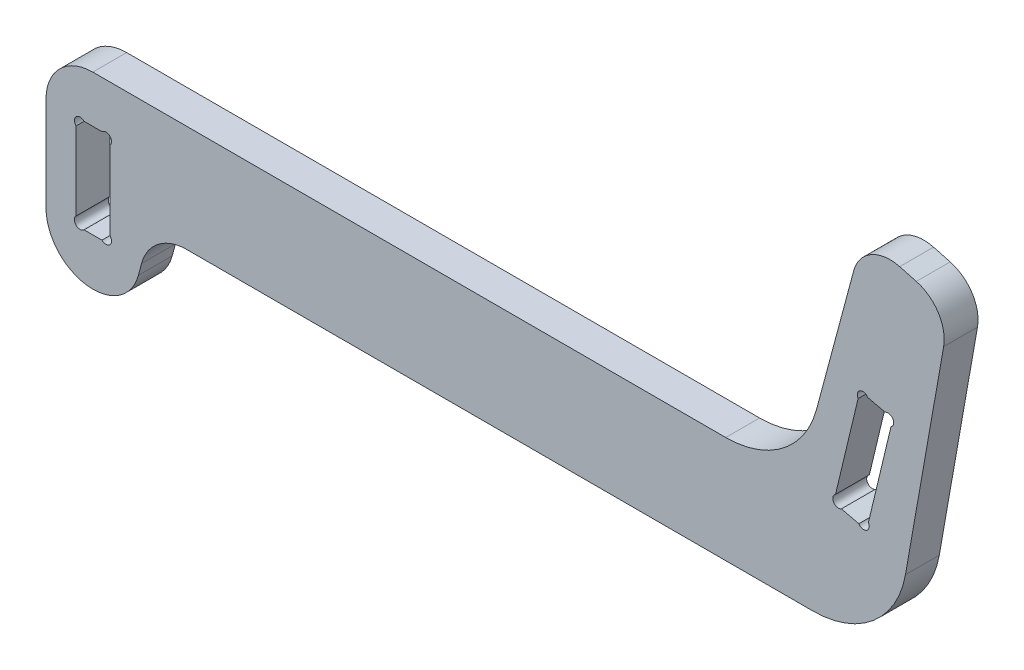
ISO-10303-21;
HEADER;
FILE_DESCRIPTION(('STEP AP214'),'2;1');
FILE_NAME('part.step','',(''),(''),'','','');
FILE_SCHEMA(('AUTOMOTIVE_DESIGN { 1 0 10303 214 1 1 1 1 }'));
ENDSEC;
DATA;
#1=APPLICATION_CONTEXT('core data for automotive mechanical design processes');
#2=APPLICATION_PROTOCOL_DEFINITION('international standard','automotive_design',2000,#1);
#3=PRODUCT_CONTEXT('',#1,'mechanical');
#4=PRODUCT('Part','Part','',(#3));
#5=PRODUCT_RELATED_PRODUCT_CATEGORY('part','',(#4));
#6=PRODUCT_DEFINITION_FORMATION('','',#4);
#7=PRODUCT_DEFINITION_CONTEXT('part definition',#1,'design');
#8=PRODUCT_DEFINITION('design','',#6,#7);
#9=PRODUCT_DEFINITION_SHAPE('','',#8);
#10=(LENGTH_UNIT() NAMED_UNIT(*) SI_UNIT(.MILLI.,.METRE.));
#11=(NAMED_UNIT(*) PLANE_ANGLE_UNIT() SI_UNIT($,.RADIAN.));
#12=(NAMED_UNIT(*) SI_UNIT($,.STERADIAN.) SOLID_ANGLE_UNIT());
#13=UNCERTAINTY_MEASURE_WITH_UNIT(LENGTH_MEASURE(1.E-05),#10,'distance_accuracy_value','');
#14=(GEOMETRIC_REPRESENTATION_CONTEXT(3) GLOBAL_UNCERTAINTY_ASSIGNED_CONTEXT((#13)) GLOBAL_UNIT_ASSIGNED_CONTEXT((#10,
#11,#12)) REPRESENTATION_CONTEXT('',''));
#15=CARTESIAN_POINT('',(0.,0.,0.));
#16=DIRECTION('',(0.,0.,1.));
#17=DIRECTION('',(1.,0.,0.));
#18=AXIS2_PLACEMENT_3D('',#15,#16,#17);
#19=CARTESIAN_POINT('',(24.9,-25.1,18.));
#20=DIRECTION('',(0.,0.,-1.));
#21=DIRECTION('',(-1.,0.,0.));
#22=AXIS2_PLACEMENT_3D('',#19,#20,#21);
#23=PLANE('',#22);
#24=DIRECTION('',(1.,0.,0.));
#25=VECTOR('',#24,1.);
#26=CARTESIAN_POINT('',(34.,-25.,18.));
#27=LINE('',#26,#25);
#28=CARTESIAN_POINT('',(20.2426406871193,-25.,18.));
#29=VERTEX_POINT('',#28);
#30=CARTESIAN_POINT('',(29.7573593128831,-25.,18.));
#31=VERTEX_POINT('',#30);
#32=EDGE_CURVE('E492',#29,#31,#27,.T.);
#33=ORIENTED_EDGE('',*,*,#32,.F.);
#34=CARTESIAN_POINT('',(18.1213203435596,-22.8786796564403,18.));
#35=DIRECTION('',(0.,0.,1.));
#36=DIRECTION('',(-1.,0.,0.));
#37=AXIS2_PLACEMENT_3D('',#34,#35,#36);
#38=CIRCLE('',#37,3.);
#39=CARTESIAN_POINT('',(16.,-20.7573593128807,18.));
#40=VERTEX_POINT('',#39);
#41=EDGE_CURVE('E447',#40,#29,#38,.T.);
#42=ORIENTED_EDGE('',*,*,#41,.F.);
#43=DIRECTION('',(0.,-1.,0.));
#44=VECTOR('',#43,1.);
#45=CARTESIAN_POINT('',(16.,-25.,18.));
#46=LINE('',#45,#44);
#47=CARTESIAN_POINT('',(16.,20.7573593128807,18.));
#48=VERTEX_POINT('',#47);
#49=EDGE_CURVE('E478',#48,#40,#46,.T.);
#50=ORIENTED_EDGE('',*,*,#49,.F.);
#51=CARTESIAN_POINT('',(18.1213203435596,22.8786796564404,18.));
#52=DIRECTION('',(0.,0.,1.));
#53=DIRECTION('',(1.,0.,0.));
#54=AXIS2_PLACEMENT_3D('',#51,#52,#53);
#55=CIRCLE('',#54,3.);
#56=CARTESIAN_POINT('',(20.2426406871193,25.,18.));
#57=VERTEX_POINT('',#56);
#58=EDGE_CURVE('E451',#57,#48,#55,.T.);
#59=ORIENTED_EDGE('',*,*,#58,.F.);
#60=DIRECTION('',(-1.,0.,0.));
#61=VECTOR('',#60,1.);
#62=CARTESIAN_POINT('',(34.,25.,18.));
#63=LINE('',#62,#61);
#64=CARTESIAN_POINT('',(29.7573593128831,25.,18.));
#65=VERTEX_POINT('',#64);
#66=EDGE_CURVE('E275',#65,#57,#63,.T.);
#67=ORIENTED_EDGE('',*,*,#66,.F.);
#68=CARTESIAN_POINT('',(31.8786796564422,22.8786796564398,18.));
#69=DIRECTION('',(0.,0.,1.));
#70=DIRECTION('',(-1.,0.,0.));
#71=AXIS2_PLACEMENT_3D('',#68,#69,#70);
#72=CIRCLE('',#71,3.00000000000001);
#73=CARTESIAN_POINT('',(34.,20.7573593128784,18.));
#74=VERTEX_POINT('',#73);
#75=EDGE_CURVE('E452',#74,#65,#72,.T.);
#76=ORIENTED_EDGE('',*,*,#75,.F.);
#77=DIRECTION('',(0.,1.,0.));
#78=VECTOR('',#77,1.);
#79=CARTESIAN_POINT('',(34.,-25.,18.));
#80=LINE('',#79,#78);
#81=CARTESIAN_POINT('',(34.,-20.7573593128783,18.));
#82=VERTEX_POINT('',#81);
#83=EDGE_CURVE('E494',#82,#74,#80,.T.);
#84=ORIENTED_EDGE('',*,*,#83,.F.);
#85=CARTESIAN_POINT('',(31.8786796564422,-22.8786796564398,18.));
#86=DIRECTION('',(0.,0.,1.));
#87=DIRECTION('',(1.,0.,0.));
#88=AXIS2_PLACEMENT_3D('',#85,#86,#87);
#89=CIRCLE('',#88,3.00000000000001);
#90=EDGE_CURVE('E457',#31,#82,#89,.T.);
#91=ORIENTED_EDGE('',*,*,#90,.F.);
#92=EDGE_LOOP('',(#33,#42,#50,#59,#67,#76,#84,#91));
#93=FACE_BOUND('',#92,.T.);
#94=DIRECTION('',(0.,-1.,0.));
#95=VECTOR('',#94,1.);
#96=CARTESIAN_POINT('',(0.,0.,18.));
#97=LINE('',#96,#95);
#98=CARTESIAN_POINT('',(0.,25.0999999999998,18.));
#99=VERTEX_POINT('',#98);
#100=CARTESIAN_POINT('',(0.,-25.1,18.));
#101=VERTEX_POINT('',#100);
#102=EDGE_CURVE('E293',#99,#101,#97,.T.);
#103=ORIENTED_EDGE('',*,*,#102,.T.);
#104=CARTESIAN_POINT('',(24.9,-25.1,18.));
#105=DIRECTION('',(0.,0.,1.));
#106=DIRECTION('',(-1.,0.,0.));
#107=AXIS2_PLACEMENT_3D('',#104,#105,#106);
#108=CIRCLE('',#107,24.9);
#109=CARTESIAN_POINT('',(24.9000000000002,-50.,18.));
#110=VERTEX_POINT('',#109);
#111=EDGE_CURVE('E296',#101,#110,#108,.T.);
#112=ORIENTED_EDGE('',*,*,#111,.T.);
#113=DIRECTION('',(1.,0.,0.));
#114=VECTOR('',#113,1.);
#115=CARTESIAN_POINT('',(24.9000000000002,-50.,18.));
#116=LINE('',#115,#114);
#117=CARTESIAN_POINT('',(25.0999999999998,-50.,18.));
#118=VERTEX_POINT('',#117);
#119=EDGE_CURVE('E299',#110,#118,#116,.T.);
#120=ORIENTED_EDGE('',*,*,#119,.T.);
#121=CARTESIAN_POINT('',(25.1,-25.1,18.));
#122=DIRECTION('',(0.,0.,1.));
#123=DIRECTION('',(1.,0.,0.));
#124=AXIS2_PLACEMENT_3D('',#121,#122,#123);
#125=CIRCLE('',#124,24.9);
#126=CARTESIAN_POINT('',(49.1520859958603,-31.5426050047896,18.));
#127=VERTEX_POINT('',#126);
#128=EDGE_CURVE('E301',#118,#127,#125,.T.);
#129=ORIENTED_EDGE('',*,*,#128,.T.);
#130=DIRECTION('',(0.258739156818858,0.965947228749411,0.));
#131=VECTOR('',#130,1.);
#132=CARTESIAN_POINT('',(49.1520859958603,-31.5426050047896,18.));
#133=LINE('',#132,#131);
#134=CARTESIAN_POINT('',(50.8479140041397,-25.2115943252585,18.));
#135=VERTEX_POINT('',#134);
#136=EDGE_CURVE('E303',#127,#135,#133,.T.);
#137=ORIENTED_EDGE('',*,*,#136,.T.);
#138=CARTESIAN_POINT('',(74.9,-31.654199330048,18.));
#139=DIRECTION('',(0.,0.,-1.));
#140=DIRECTION('',(1.,0.,0.));
#141=AXIS2_PLACEMENT_3D('',#138,#139,#140);
#142=CIRCLE('',#141,24.9);
#143=CARTESIAN_POINT('',(74.9,-6.75419933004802,18.));
#144=VERTEX_POINT('',#143);
#145=EDGE_CURVE('E305',#135,#144,#142,.T.);
#146=ORIENTED_EDGE('',*,*,#145,.T.);
#147=DIRECTION('',(1.,0.,0.));
#148=VECTOR('',#147,1.);
#149=CARTESIAN_POINT('',(74.9,-6.75419933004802,18.));
#150=LINE('',#149,#148);
#151=CARTESIAN_POINT('',(407.99432757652,-6.75419933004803,18.));
#152=VERTEX_POINT('',#151);
#153=EDGE_CURVE('E307',#144,#152,#150,.T.);
#154=ORIENTED_EDGE('',*,*,#153,.T.);
#155=CARTESIAN_POINT('',(407.99432757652,43.245800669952,18.));
#156=DIRECTION('',(0.,0.,1.));
#157=DIRECTION('',(-1.,0.,0.));
#158=AXIS2_PLACEMENT_3D('',#155,#156,#157);
#159=CIRCLE('',#158,50.);
#160=CARTESIAN_POINT('',(457.234715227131,34.5633917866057,18.));
#161=VERTEX_POINT('',#160);
#162=EDGE_CURVE('E309',#152,#161,#159,.T.);
#163=ORIENTED_EDGE('',*,*,#162,.T.);
#164=DIRECTION('',(0.173648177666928,0.984807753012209,0.));
#165=VECTOR('',#164,1.);
#166=CARTESIAN_POINT('',(457.234715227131,34.5633917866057,18.));
#167=LINE('',#166,#165);
#168=CARTESIAN_POINT('',(477.559381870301,149.830304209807,18.));
#169=VERTEX_POINT('',#168);
#170=EDGE_CURVE('E311',#161,#169,#167,.T.);
#171=ORIENTED_EDGE('',*,*,#170,.T.);
#172=CARTESIAN_POINT('',(457.863226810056,153.303267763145,18.));
#173=DIRECTION('',(0.,0.,1.));
#174=DIRECTION('',(-1.,0.,0.));
#175=AXIS2_PLACEMENT_3D('',#172,#173,#174);
#176=CIRCLE('',#175,20.);
#177=CARTESIAN_POINT('',(463.039607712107,172.621784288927,18.));
#178=VERTEX_POINT('',#177);
#179=EDGE_CURVE('E313',#169,#178,#176,.T.);
#180=ORIENTED_EDGE('',*,*,#179,.T.);
#181=DIRECTION('',(-0.965925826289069,0.258819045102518,0.));
#182=VECTOR('',#181,1.);
#183=CARTESIAN_POINT('',(454.196815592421,174.991203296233,18.));
#184=LINE('',#183,#182);
#185=CARTESIAN_POINT('',(454.196815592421,174.991203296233,18.));
#186=VERTEX_POINT('',#185);
#187=EDGE_CURVE('E315',#178,#186,#184,.T.);
#188=ORIENTED_EDGE('',*,*,#187,.T.);
#189=CARTESIAN_POINT('',(449.020434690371,155.672686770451,18.));
#190=DIRECTION('',(0.,0.,1.));
#191=DIRECTION('',(1.,0.,0.));
#192=AXIS2_PLACEMENT_3D('',#189,#190,#191);
#193=CIRCLE('',#192,20.);
#194=CARTESIAN_POINT('',(429.701918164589,160.849067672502,18.));
#195=VERTEX_POINT('',#194);
#196=EDGE_CURVE('E317',#186,#195,#193,.T.);
#197=ORIENTED_EDGE('',*,*,#196,.T.);
#198=DIRECTION('',(-0.258819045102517,-0.965925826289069,0.));
#199=VECTOR('',#198,1.);
#200=CARTESIAN_POINT('',(409.929941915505,87.0590477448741,18.));
#201=LINE('',#200,#199);
#202=CARTESIAN_POINT('',(409.929941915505,87.0590477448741,18.));
#203=VERTEX_POINT('',#202);
#204=EDGE_CURVE('E319',#195,#203,#201,.T.);
#205=ORIENTED_EDGE('',*,*,#204,.T.);
#206=CARTESIAN_POINT('',(361.633650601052,100.,18.));
#207=DIRECTION('',(0.,0.,-1.));
#208=DIRECTION('',(-1.,0.,0.));
#209=AXIS2_PLACEMENT_3D('',#206,#207,#208);
#210=CIRCLE('',#209,50.);
#211=CARTESIAN_POINT('',(361.633650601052,50.,18.));
#212=VERTEX_POINT('',#211);
#213=EDGE_CURVE('E321',#203,#212,#210,.T.);
#214=ORIENTED_EDGE('',*,*,#213,.T.);
#215=DIRECTION('',(-1.,0.,0.));
#216=VECTOR('',#215,1.);
#217=CARTESIAN_POINT('',(24.9000000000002,50.,18.));
#218=LINE('',#217,#216);
#219=CARTESIAN_POINT('',(24.9000000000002,50.,18.));
#220=VERTEX_POINT('',#219);
#221=EDGE_CURVE('E323',#212,#220,#218,.T.);
#222=ORIENTED_EDGE('',*,*,#221,.T.);
#223=CARTESIAN_POINT('',(24.9,25.1,18.));
#224=DIRECTION('',(0.,0.,1.));
#225=DIRECTION('',(-1.,0.,0.));
#226=AXIS2_PLACEMENT_3D('',#223,#224,#225);
#227=CIRCLE('',#226,24.9);
#228=EDGE_CURVE('E325',#220,#99,#227,.T.);
#229=ORIENTED_EDGE('',*,*,#228,.T.);
#230=EDGE_LOOP('',(#103,#112,#120,#129,#137,#146,#154,#163,#171,#180,#188,#197,#205,#214,#222,#229));
#231=FACE_BOUND('',#230,.T.);
#232=DIRECTION('',(0.97249933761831,-0.232905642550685,0.));
#233=VECTOR('',#232,1.);
#234=CARTESIAN_POINT('',(419.052037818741,48.8908734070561,18.));
#235=LINE('',#234,#233);
#236=CARTESIAN_POINT('',(423.178003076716,47.9027384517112,18.));
#237=VERTEX_POINT('',#236);
#238=CARTESIAN_POINT('',(432.431060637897,45.6867067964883,18.));
#239=VERTEX_POINT('',#238);
#240=EDGE_CURVE('E270',#237,#239,#235,.T.);
#241=ORIENTED_EDGE('',*,*,#240,.F.);
#242=CARTESIAN_POINT('',(421.609087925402,50.459788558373,18.));
#243=DIRECTION('',(0.,0.,1.));
#244=DIRECTION('',(-1.,0.,0.));
#245=AXIS2_PLACEMENT_3D('',#242,#243,#244);
#246=CIRCLE('',#245,3.00000000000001);
#247=CARTESIAN_POINT('',(420.040172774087,53.0168386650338,18.));
#248=VERTEX_POINT('',#247);
#249=EDGE_CURVE('E46',#248,#237,#246,.T.);
#250=ORIENTED_EDGE('',*,*,#249,.F.);
#251=DIRECTION('',(-0.232905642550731,-0.972499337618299,0.));
#252=VECTOR('',#251,1.);
#253=CARTESIAN_POINT('',(433.026376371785,107.240833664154,18.));
#254=LINE('',#253,#252);
#255=CARTESIAN_POINT('',(432.03824141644,103.114868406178,18.));
#256=VERTEX_POINT('',#255);
#257=EDGE_CURVE('E249',#256,#248,#254,.T.);
#258=ORIENTED_EDGE('',*,*,#257,.F.);
#259=CARTESIAN_POINT('',(434.5952915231,104.683783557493,18.));
#260=DIRECTION('',(0.,0.,1.));
#261=DIRECTION('',(1.,0.,0.));
#262=AXIS2_PLACEMENT_3D('',#259,#260,#261);
#263=CIRCLE('',#262,2.99999999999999);
#264=CARTESIAN_POINT('',(437.152341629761,106.252698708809,18.));
#265=VERTEX_POINT('',#264);
#266=EDGE_CURVE('E242',#265,#256,#263,.T.);
#267=ORIENTED_EDGE('',*,*,#266,.F.);
#268=DIRECTION('',(-0.97249933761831,0.232905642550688,0.));
#269=VECTOR('',#268,1.);
#270=CARTESIAN_POINT('',(435.089359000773,106.746766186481,18.));
#271=LINE('',#270,#269);
#272=CARTESIAN_POINT('',(446.405399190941,104.036667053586,18.));
#273=VERTEX_POINT('',#272);
#274=EDGE_CURVE('E247',#273,#265,#271,.T.);
#275=ORIENTED_EDGE('',*,*,#274,.F.);
#276=CARTESIAN_POINT('',(447.974314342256,101.479616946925,18.));
#277=DIRECTION('',(0.,0.,1.));
#278=DIRECTION('',(-1.,0.,0.));
#279=AXIS2_PLACEMENT_3D('',#276,#277,#278);
#280=CIRCLE('',#279,3.00000000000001);
#281=CARTESIAN_POINT('',(449.543229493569,98.9225668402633,18.));
#282=VERTEX_POINT('',#281);
#283=EDGE_CURVE('E430',#282,#273,#280,.T.);
#284=ORIENTED_EDGE('',*,*,#283,.F.);
#285=DIRECTION('',(0.232905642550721,0.972499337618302,0.));
#286=VECTOR('',#285,1.);
#287=CARTESIAN_POINT('',(450.531364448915,103.048532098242,18.));
#288=LINE('',#287,#286);
#289=CARTESIAN_POINT('',(437.545160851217,48.8245370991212,18.));
#290=VERTEX_POINT('',#289);
#291=EDGE_CURVE('E280',#290,#282,#288,.T.);
#292=ORIENTED_EDGE('',*,*,#291,.F.);
#293=CARTESIAN_POINT('',(434.988110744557,47.2556219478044,18.));
#294=DIRECTION('',(0.,0.,1.));
#295=DIRECTION('',(1.,0.,0.));
#296=AXIS2_PLACEMENT_3D('',#293,#294,#295);
#297=CIRCLE('',#296,2.99999999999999);
#298=EDGE_CURVE('E54',#239,#290,#297,.T.);
#299=ORIENTED_EDGE('',*,*,#298,.F.);
#300=EDGE_LOOP('',(#241,#250,#258,#267,#275,#284,#292,#299));
#301=FACE_BOUND('',#300,.T.);
#302=ADVANCED_FACE('F32',(#93,#231,#301),#23,.F.);
#303=CARTESIAN_POINT('',(24.9,-25.1,0.));
#304=DIRECTION('',(0.,0.,-1.));
#305=DIRECTION('',(-1.,0.,0.));
#306=AXIS2_PLACEMENT_3D('',#303,#304,#305);
#307=PLANE('',#306);
#308=CARTESIAN_POINT('',(421.609087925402,50.459788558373,0.));
#309=DIRECTION('',(0.,0.,1.));
#310=DIRECTION('',(-1.,0.,0.));
#311=AXIS2_PLACEMENT_3D('',#308,#309,#310);
#312=CIRCLE('',#311,3.00000000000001);
#313=CARTESIAN_POINT('',(420.040172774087,53.0168386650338,0.));
#314=VERTEX_POINT('',#313);
#315=CARTESIAN_POINT('',(423.178003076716,47.9027384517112,0.));
#316=VERTEX_POINT('',#315);
#317=EDGE_CURVE('E433',#314,#316,#312,.T.);
#318=ORIENTED_EDGE('',*,*,#317,.T.);
#319=DIRECTION('',(0.97249933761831,-0.232905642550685,0.));
#320=VECTOR('',#319,1.);
#321=CARTESIAN_POINT('',(419.052037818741,48.8908734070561,0.));
#322=LINE('',#321,#320);
#323=CARTESIAN_POINT('',(432.431060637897,45.6867067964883,0.));
#324=VERTEX_POINT('',#323);
#325=EDGE_CURVE('E287',#316,#324,#322,.T.);
#326=ORIENTED_EDGE('',*,*,#325,.T.);
#327=CARTESIAN_POINT('',(434.988110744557,47.2556219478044,0.));
#328=DIRECTION('',(0.,0.,1.));
#329=DIRECTION('',(1.,0.,0.));
#330=AXIS2_PLACEMENT_3D('',#327,#328,#329);
#331=CIRCLE('',#330,2.99999999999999);
#332=CARTESIAN_POINT('',(437.545160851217,48.8245370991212,0.));
#333=VERTEX_POINT('',#332);
#334=EDGE_CURVE('E419',#324,#333,#331,.T.);
#335=ORIENTED_EDGE('',*,*,#334,.T.);
#336=DIRECTION('',(0.232905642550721,0.972499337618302,0.));
#337=VECTOR('',#336,1.);
#338=CARTESIAN_POINT('',(450.531364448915,103.048532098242,0.));
#339=LINE('',#338,#337);
#340=CARTESIAN_POINT('',(449.543229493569,98.9225668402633,0.));
#341=VERTEX_POINT('',#340);
#342=EDGE_CURVE('E272',#333,#341,#339,.T.);
#343=ORIENTED_EDGE('',*,*,#342,.T.);
#344=CARTESIAN_POINT('',(447.974314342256,101.479616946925,0.));
#345=DIRECTION('',(0.,0.,1.));
#346=DIRECTION('',(-1.,0.,0.));
#347=AXIS2_PLACEMENT_3D('',#344,#345,#346);
#348=CIRCLE('',#347,3.00000000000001);
#349=CARTESIAN_POINT('',(446.405399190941,104.036667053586,0.));
#350=VERTEX_POINT('',#349);
#351=EDGE_CURVE('E253',#341,#350,#348,.T.);
#352=ORIENTED_EDGE('',*,*,#351,.T.);
#353=DIRECTION('',(-0.972499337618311,0.232905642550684,0.));
#354=VECTOR('',#353,1.);
#355=CARTESIAN_POINT('',(437.152341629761,106.252698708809,0.));
#356=LINE('',#355,#354);
#357=CARTESIAN_POINT('',(437.152341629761,106.252698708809,0.));
#358=VERTEX_POINT('',#357);
#359=EDGE_CURVE('E268',#350,#358,#356,.T.);
#360=ORIENTED_EDGE('',*,*,#359,.T.);
#361=CARTESIAN_POINT('',(434.5952915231,104.683783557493,0.));
#362=DIRECTION('',(0.,0.,1.));
#363=DIRECTION('',(1.,0.,0.));
#364=AXIS2_PLACEMENT_3D('',#361,#362,#363);
#365=CIRCLE('',#364,2.99999999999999);
#366=CARTESIAN_POINT('',(432.03824141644,103.114868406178,0.));
#367=VERTEX_POINT('',#366);
#368=EDGE_CURVE('E252',#358,#367,#365,.T.);
#369=ORIENTED_EDGE('',*,*,#368,.T.);
#370=DIRECTION('',(-0.232905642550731,-0.972499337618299,0.));
#371=VECTOR('',#370,1.);
#372=CARTESIAN_POINT('',(433.026376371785,107.240833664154,0.));
#373=LINE('',#372,#371);
#374=EDGE_CURVE('E284',#367,#314,#373,.T.);
#375=ORIENTED_EDGE('',*,*,#374,.T.);
#376=EDGE_LOOP('',(#318,#326,#335,#343,#352,#360,#369,#375));
#377=FACE_BOUND('',#376,.T.);
#378=CARTESIAN_POINT('',(18.1213203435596,-22.8786796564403,0.));
#379=DIRECTION('',(0.,0.,1.));
#380=DIRECTION('',(-1.,0.,0.));
#381=AXIS2_PLACEMENT_3D('',#378,#379,#380);
#382=CIRCLE('',#381,3.);
#383=CARTESIAN_POINT('',(16.,-20.7573593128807,0.));
#384=VERTEX_POINT('',#383);
#385=CARTESIAN_POINT('',(20.2426406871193,-25.,0.));
#386=VERTEX_POINT('',#385);
#387=EDGE_CURVE('E459',#384,#386,#382,.T.);
#388=ORIENTED_EDGE('',*,*,#387,.T.);
#389=DIRECTION('',(1.,0.,0.));
#390=VECTOR('',#389,1.);
#391=CARTESIAN_POINT('',(34.,-25.,0.));
#392=LINE('',#391,#390);
#393=CARTESIAN_POINT('',(29.7573593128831,-25.,0.));
#394=VERTEX_POINT('',#393);
#395=EDGE_CURVE('E482',#386,#394,#392,.T.);
#396=ORIENTED_EDGE('',*,*,#395,.T.);
#397=CARTESIAN_POINT('',(31.8786796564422,-22.8786796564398,0.));
#398=DIRECTION('',(0.,0.,1.));
#399=DIRECTION('',(1.,0.,0.));
#400=AXIS2_PLACEMENT_3D('',#397,#398,#399);
#401=CIRCLE('',#400,3.00000000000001);
#402=CARTESIAN_POINT('',(34.,-20.7573593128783,0.));
#403=VERTEX_POINT('',#402);
#404=EDGE_CURVE('E454',#394,#403,#401,.T.);
#405=ORIENTED_EDGE('',*,*,#404,.T.);
#406=DIRECTION('',(0.,1.,0.));
#407=VECTOR('',#406,1.);
#408=CARTESIAN_POINT('',(34.,-25.,0.));
#409=LINE('',#408,#407);
#410=CARTESIAN_POINT('',(34.,20.7573593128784,0.));
#411=VERTEX_POINT('',#410);
#412=EDGE_CURVE('E485',#403,#411,#409,.T.);
#413=ORIENTED_EDGE('',*,*,#412,.T.);
#414=CARTESIAN_POINT('',(31.8786796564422,22.8786796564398,0.));
#415=DIRECTION('',(0.,0.,1.));
#416=DIRECTION('',(-1.,0.,0.));
#417=AXIS2_PLACEMENT_3D('',#414,#415,#416);
#418=CIRCLE('',#417,3.00000000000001);
#419=CARTESIAN_POINT('',(29.7573593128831,25.,0.));
#420=VERTEX_POINT('',#419);
#421=EDGE_CURVE('E448',#411,#420,#418,.T.);
#422=ORIENTED_EDGE('',*,*,#421,.T.);
#423=DIRECTION('',(-1.,0.,0.));
#424=VECTOR('',#423,1.);
#425=CARTESIAN_POINT('',(34.,25.,0.));
#426=LINE('',#425,#424);
#427=CARTESIAN_POINT('',(20.2426406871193,25.,0.));
#428=VERTEX_POINT('',#427);
#429=EDGE_CURVE('E288',#420,#428,#426,.T.);
#430=ORIENTED_EDGE('',*,*,#429,.T.);
#431=CARTESIAN_POINT('',(18.1213203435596,22.8786796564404,0.));
#432=DIRECTION('',(0.,0.,1.));
#433=DIRECTION('',(1.,0.,0.));
#434=AXIS2_PLACEMENT_3D('',#431,#432,#433);
#435=CIRCLE('',#434,3.);
#436=CARTESIAN_POINT('',(16.,20.7573593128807,0.));
#437=VERTEX_POINT('',#436);
#438=EDGE_CURVE('E462',#428,#437,#435,.T.);
#439=ORIENTED_EDGE('',*,*,#438,.T.);
#440=DIRECTION('',(0.,-1.,0.));
#441=VECTOR('',#440,1.);
#442=CARTESIAN_POINT('',(16.,-25.,0.));
#443=LINE('',#442,#441);
#444=EDGE_CURVE('E479',#437,#384,#443,.T.);
#445=ORIENTED_EDGE('',*,*,#444,.T.);
#446=EDGE_LOOP('',(#388,#396,#405,#413,#422,#430,#439,#445));
#447=FACE_BOUND('',#446,.T.);
#448=CARTESIAN_POINT('',(24.9,-25.1,0.));
#449=DIRECTION('',(0.,0.,1.));
#450=DIRECTION('',(-1.,0.,0.));
#451=AXIS2_PLACEMENT_3D('',#448,#449,#450);
#452=CIRCLE('',#451,24.9);
#453=CARTESIAN_POINT('',(0.,-25.1,0.));
#454=VERTEX_POINT('',#453);
#455=CARTESIAN_POINT('',(24.9000000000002,-50.,0.));
#456=VERTEX_POINT('',#455);
#457=EDGE_CURVE('E283',#454,#456,#452,.T.);
#458=ORIENTED_EDGE('',*,*,#457,.F.);
#459=DIRECTION('',(0.,-1.,0.));
#460=VECTOR('',#459,1.);
#461=CARTESIAN_POINT('',(0.,0.,0.));
#462=LINE('',#461,#460);
#463=CARTESIAN_POINT('',(0.,25.0999999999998,0.));
#464=VERTEX_POINT('',#463);
#465=EDGE_CURVE('E297',#464,#454,#462,.T.);
#466=ORIENTED_EDGE('',*,*,#465,.F.);
#467=CARTESIAN_POINT('',(24.9,25.1,0.));
#468=DIRECTION('',(0.,0.,1.));
#469=DIRECTION('',(-1.,0.,0.));
#470=AXIS2_PLACEMENT_3D('',#467,#468,#469);
#471=CIRCLE('',#470,24.9);
#472=CARTESIAN_POINT('',(24.9000000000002,50.,0.));
#473=VERTEX_POINT('',#472);
#474=EDGE_CURVE('E356',#473,#464,#471,.T.);
#475=ORIENTED_EDGE('',*,*,#474,.F.);
#476=DIRECTION('',(-1.,0.,0.));
#477=VECTOR('',#476,1.);
#478=CARTESIAN_POINT('',(24.9000000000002,50.,0.));
#479=LINE('',#478,#477);
#480=CARTESIAN_POINT('',(361.633650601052,50.,0.));
#481=VERTEX_POINT('',#480);
#482=EDGE_CURVE('E354',#481,#473,#479,.T.);
#483=ORIENTED_EDGE('',*,*,#482,.F.);
#484=CARTESIAN_POINT('',(361.633650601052,100.,0.));
#485=DIRECTION('',(0.,0.,-1.));
#486=DIRECTION('',(-1.,0.,0.));
#487=AXIS2_PLACEMENT_3D('',#484,#485,#486);
#488=CIRCLE('',#487,50.);
#489=CARTESIAN_POINT('',(409.929941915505,87.0590477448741,0.));
#490=VERTEX_POINT('',#489);
#491=EDGE_CURVE('E352',#490,#481,#488,.T.);
#492=ORIENTED_EDGE('',*,*,#491,.F.);
#493=DIRECTION('',(-0.258819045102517,-0.965925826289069,0.));
#494=VECTOR('',#493,1.);
#495=CARTESIAN_POINT('',(409.929941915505,87.0590477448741,0.));
#496=LINE('',#495,#494);
#497=CARTESIAN_POINT('',(429.701918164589,160.849067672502,0.));
#498=VERTEX_POINT('',#497);
#499=EDGE_CURVE('E350',#498,#490,#496,.T.);
#500=ORIENTED_EDGE('',*,*,#499,.F.);
#501=CARTESIAN_POINT('',(449.020434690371,155.672686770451,0.));
#502=DIRECTION('',(0.,0.,1.));
#503=DIRECTION('',(1.,0.,0.));
#504=AXIS2_PLACEMENT_3D('',#501,#502,#503);
#505=CIRCLE('',#504,20.);
#506=CARTESIAN_POINT('',(454.196815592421,174.991203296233,0.));
#507=VERTEX_POINT('',#506);
#508=EDGE_CURVE('E348',#507,#498,#505,.T.);
#509=ORIENTED_EDGE('',*,*,#508,.F.);
#510=DIRECTION('',(-0.965925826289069,0.258819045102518,0.));
#511=VECTOR('',#510,1.);
#512=CARTESIAN_POINT('',(454.196815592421,174.991203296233,0.));
#513=LINE('',#512,#511);
#514=CARTESIAN_POINT('',(463.039607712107,172.621784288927,0.));
#515=VERTEX_POINT('',#514);
#516=EDGE_CURVE('E346',#515,#507,#513,.T.);
#517=ORIENTED_EDGE('',*,*,#516,.F.);
#518=CARTESIAN_POINT('',(457.863226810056,153.303267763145,0.));
#519=DIRECTION('',(0.,0.,1.));
#520=DIRECTION('',(-1.,0.,0.));
#521=AXIS2_PLACEMENT_3D('',#518,#519,#520);
#522=CIRCLE('',#521,20.);
#523=CARTESIAN_POINT('',(477.559381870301,149.830304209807,0.));
#524=VERTEX_POINT('',#523);
#525=EDGE_CURVE('E344',#524,#515,#522,.T.);
#526=ORIENTED_EDGE('',*,*,#525,.F.);
#527=DIRECTION('',(0.173648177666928,0.984807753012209,0.));
#528=VECTOR('',#527,1.);
#529=CARTESIAN_POINT('',(457.234715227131,34.5633917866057,0.));
#530=LINE('',#529,#528);
#531=CARTESIAN_POINT('',(457.234715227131,34.5633917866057,0.));
#532=VERTEX_POINT('',#531);
#533=EDGE_CURVE('E342',#532,#524,#530,.T.);
#534=ORIENTED_EDGE('',*,*,#533,.F.);
#535=CARTESIAN_POINT('',(407.99432757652,43.245800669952,0.));
#536=DIRECTION('',(0.,0.,1.));
#537=DIRECTION('',(-1.,0.,0.));
#538=AXIS2_PLACEMENT_3D('',#535,#536,#537);
#539=CIRCLE('',#538,50.);
#540=CARTESIAN_POINT('',(407.99432757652,-6.75419933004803,0.));
#541=VERTEX_POINT('',#540);
#542=EDGE_CURVE('E340',#541,#532,#539,.T.);
#543=ORIENTED_EDGE('',*,*,#542,.F.);
#544=DIRECTION('',(1.,0.,0.));
#545=VECTOR('',#544,1.);
#546=CARTESIAN_POINT('',(74.9,-6.75419933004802,0.));
#547=LINE('',#546,#545);
#548=CARTESIAN_POINT('',(74.9,-6.75419933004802,0.));
#549=VERTEX_POINT('',#548);
#550=EDGE_CURVE('E338',#549,#541,#547,.T.);
#551=ORIENTED_EDGE('',*,*,#550,.F.);
#552=CARTESIAN_POINT('',(74.9,-31.654199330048,0.));
#553=DIRECTION('',(0.,0.,-1.));
#554=DIRECTION('',(1.,0.,0.));
#555=AXIS2_PLACEMENT_3D('',#552,#553,#554);
#556=CIRCLE('',#555,24.9);
#557=CARTESIAN_POINT('',(50.8479140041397,-25.2115943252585,0.));
#558=VERTEX_POINT('',#557);
#559=EDGE_CURVE('E336',#558,#549,#556,.T.);
#560=ORIENTED_EDGE('',*,*,#559,.F.);
#561=DIRECTION('',(0.258739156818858,0.965947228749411,0.));
#562=VECTOR('',#561,1.);
#563=CARTESIAN_POINT('',(49.1520859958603,-31.5426050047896,0.));
#564=LINE('',#563,#562);
#565=CARTESIAN_POINT('',(49.1520859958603,-31.5426050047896,0.));
#566=VERTEX_POINT('',#565);
#567=EDGE_CURVE('E334',#566,#558,#564,.T.);
#568=ORIENTED_EDGE('',*,*,#567,.F.);
#569=CARTESIAN_POINT('',(25.1,-25.1,0.));
#570=DIRECTION('',(0.,0.,1.));
#571=DIRECTION('',(1.,0.,0.));
#572=AXIS2_PLACEMENT_3D('',#569,#570,#571);
#573=CIRCLE('',#572,24.9);
#574=CARTESIAN_POINT('',(25.0999999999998,-50.,0.));
#575=VERTEX_POINT('',#574);
#576=EDGE_CURVE('E332',#575,#566,#573,.T.);
#577=ORIENTED_EDGE('',*,*,#576,.F.);
#578=DIRECTION('',(1.,0.,0.));
#579=VECTOR('',#578,1.);
#580=CARTESIAN_POINT('',(24.9000000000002,-50.,0.));
#581=LINE('',#580,#579);
#582=EDGE_CURVE('E330',#456,#575,#581,.T.);
#583=ORIENTED_EDGE('',*,*,#582,.F.);
#584=EDGE_LOOP('',(#458,#466,#475,#483,#492,#500,#509,#517,#526,#534,#543,#551,#560,#568,#577,#583));
#585=FACE_BOUND('',#584,.T.);
#586=ADVANCED_FACE('F427',(#377,#447,#585),#307,.T.);
#587=CARTESIAN_POINT('',(24.9,-25.1,18.));
#588=DIRECTION('',(0.,0.,-1.));
#589=DIRECTION('',(-1.,0.,0.));
#590=AXIS2_PLACEMENT_3D('',#587,#588,#589);
#591=CYLINDRICAL_SURFACE('',#590,24.9);
#592=ORIENTED_EDGE('',*,*,#457,.T.);
#593=DIRECTION('',(0.,0.,-1.));
#594=VECTOR('',#593,1.);
#595=CARTESIAN_POINT('',(24.9000000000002,-50.,18.));
#596=LINE('',#595,#594);
#597=EDGE_CURVE('E400',#110,#456,#596,.T.);
#598=ORIENTED_EDGE('',*,*,#597,.F.);
#599=ORIENTED_EDGE('',*,*,#111,.F.);
#600=DIRECTION('',(0.,0.,-1.));
#601=VECTOR('',#600,1.);
#602=CARTESIAN_POINT('',(0.,-25.1,18.));
#603=LINE('',#602,#601);
#604=EDGE_CURVE('E403',#101,#454,#603,.T.);
#605=ORIENTED_EDGE('',*,*,#604,.T.);
#606=EDGE_LOOP('',(#592,#598,#599,#605));
#607=FACE_BOUND('',#606,.T.);
#608=ADVANCED_FACE('F34',(#607),#591,.T.);
#609=CARTESIAN_POINT('',(24.9000000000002,-50.,18.));
#610=DIRECTION('',(0.,1.,0.));
#611=DIRECTION('',(0.,0.,1.));
#612=AXIS2_PLACEMENT_3D('',#609,#610,#611);
#613=PLANE('',#612);
#614=ORIENTED_EDGE('',*,*,#582,.T.);
#615=DIRECTION('',(0.,0.,-1.));
#616=VECTOR('',#615,1.);
#617=CARTESIAN_POINT('',(25.0999999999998,-50.,18.));
#618=LINE('',#617,#616);
#619=EDGE_CURVE('E397',#118,#575,#618,.T.);
#620=ORIENTED_EDGE('',*,*,#619,.F.);
#621=ORIENTED_EDGE('',*,*,#119,.F.);
#622=ORIENTED_EDGE('',*,*,#597,.T.);
#623=EDGE_LOOP('',(#614,#620,#621,#622));
#624=FACE_BOUND('',#623,.T.);
#625=ADVANCED_FACE('F603',(#624),#613,.F.);
#626=CARTESIAN_POINT('',(25.1,-25.1,18.));
#627=DIRECTION('',(0.,0.,-1.));
#628=DIRECTION('',(-1.,0.,0.));
#629=AXIS2_PLACEMENT_3D('',#626,#627,#628);
#630=CYLINDRICAL_SURFACE('',#629,24.9);
#631=ORIENTED_EDGE('',*,*,#576,.T.);
#632=DIRECTION('',(0.,0.,-1.));
#633=VECTOR('',#632,1.);
#634=CARTESIAN_POINT('',(49.1520859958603,-31.5426050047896,18.));
#635=LINE('',#634,#633);
#636=EDGE_CURVE('E394',#127,#566,#635,.T.);
#637=ORIENTED_EDGE('',*,*,#636,.F.);
#638=ORIENTED_EDGE('',*,*,#128,.F.);
#639=ORIENTED_EDGE('',*,*,#619,.T.);
#640=EDGE_LOOP('',(#631,#637,#638,#639));
#641=FACE_BOUND('',#640,.T.);
#642=ADVANCED_FACE('F600',(#641),#630,.T.);
#643=CARTESIAN_POINT('',(49.1520859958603,-31.5426050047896,18.));
#644=DIRECTION('',(-0.965947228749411,0.258739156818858,0.));
#645=DIRECTION('',(-0.258739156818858,-0.965947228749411,0.));
#646=AXIS2_PLACEMENT_3D('',#643,#644,#645);
#647=PLANE('',#646);
#648=ORIENTED_EDGE('',*,*,#567,.T.);
#649=DIRECTION('',(0.,0.,-1.));
#650=VECTOR('',#649,1.);
#651=CARTESIAN_POINT('',(50.8479140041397,-25.2115943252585,18.));
#652=LINE('',#651,#650);
#653=EDGE_CURVE('E391',#135,#558,#652,.T.);
#654=ORIENTED_EDGE('',*,*,#653,.F.);
#655=ORIENTED_EDGE('',*,*,#136,.F.);
#656=ORIENTED_EDGE('',*,*,#636,.T.);
#657=EDGE_LOOP('',(#648,#654,#655,#656));
#658=FACE_BOUND('',#657,.T.);
#659=ADVANCED_FACE('F596',(#658),#647,.F.);
#660=CARTESIAN_POINT('',(74.9,-31.654199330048,18.));
#661=DIRECTION('',(0.,0.,-1.));
#662=DIRECTION('',(-1.,0.,0.));
#663=AXIS2_PLACEMENT_3D('',#660,#661,#662);
#664=CYLINDRICAL_SURFACE('',#663,24.9);
#665=ORIENTED_EDGE('',*,*,#559,.T.);
#666=DIRECTION('',(0.,0.,-1.));
#667=VECTOR('',#666,1.);
#668=CARTESIAN_POINT('',(74.9,-6.75419933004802,18.));
#669=LINE('',#668,#667);
#670=EDGE_CURVE('E388',#144,#549,#669,.T.);
#671=ORIENTED_EDGE('',*,*,#670,.F.);
#672=ORIENTED_EDGE('',*,*,#145,.F.);
#673=ORIENTED_EDGE('',*,*,#653,.T.);
#674=EDGE_LOOP('',(#665,#671,#672,#673));
#675=FACE_BOUND('',#674,.T.);
#676=ADVANCED_FACE('F592',(#675),#664,.F.);
#677=CARTESIAN_POINT('',(74.9,-6.75419933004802,18.));
#678=DIRECTION('',(0.,1.,0.));
#679=DIRECTION('',(0.,0.,1.));
#680=AXIS2_PLACEMENT_3D('',#677,#678,#679);
#681=PLANE('',#680);
#682=ORIENTED_EDGE('',*,*,#550,.T.);
#683=DIRECTION('',(0.,0.,-1.));
#684=VECTOR('',#683,1.);
#685=CARTESIAN_POINT('',(407.99432757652,-6.75419933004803,18.));
#686=LINE('',#685,#684);
#687=EDGE_CURVE('E385',#152,#541,#686,.T.);
#688=ORIENTED_EDGE('',*,*,#687,.F.);
#689=ORIENTED_EDGE('',*,*,#153,.F.);
#690=ORIENTED_EDGE('',*,*,#670,.T.);
#691=EDGE_LOOP('',(#682,#688,#689,#690));
#692=FACE_BOUND('',#691,.T.);
#693=ADVANCED_FACE('F588',(#692),#681,.F.);
#694=CARTESIAN_POINT('',(407.99432757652,43.245800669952,18.));
#695=DIRECTION('',(0.,0.,-1.));
#696=DIRECTION('',(-1.,0.,0.));
#697=AXIS2_PLACEMENT_3D('',#694,#695,#696);
#698=CYLINDRICAL_SURFACE('',#697,50.);
#699=ORIENTED_EDGE('',*,*,#542,.T.);
#700=DIRECTION('',(0.,0.,-1.));
#701=VECTOR('',#700,1.);
#702=CARTESIAN_POINT('',(457.234715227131,34.5633917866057,18.));
#703=LINE('',#702,#701);
#704=EDGE_CURVE('E382',#161,#532,#703,.T.);
#705=ORIENTED_EDGE('',*,*,#704,.F.);
#706=ORIENTED_EDGE('',*,*,#162,.F.);
#707=ORIENTED_EDGE('',*,*,#687,.T.);
#708=EDGE_LOOP('',(#699,#705,#706,#707));
#709=FACE_BOUND('',#708,.T.);
#710=ADVANCED_FACE('F584',(#709),#698,.T.);
#711=CARTESIAN_POINT('',(457.234715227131,34.5633917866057,18.));
#712=DIRECTION('',(-0.984807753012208,0.173648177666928,0.));
#713=DIRECTION('',(-0.173648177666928,-0.984807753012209,0.));
#714=AXIS2_PLACEMENT_3D('',#711,#712,#713);
#715=PLANE('',#714);
#716=ORIENTED_EDGE('',*,*,#533,.T.);
#717=DIRECTION('',(0.,0.,-1.));
#718=VECTOR('',#717,1.);
#719=CARTESIAN_POINT('',(477.559381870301,149.830304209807,18.));
#720=LINE('',#719,#718);
#721=EDGE_CURVE('E379',#169,#524,#720,.T.);
#722=ORIENTED_EDGE('',*,*,#721,.F.);
#723=ORIENTED_EDGE('',*,*,#170,.F.);
#724=ORIENTED_EDGE('',*,*,#704,.T.);
#725=EDGE_LOOP('',(#716,#722,#723,#724));
#726=FACE_BOUND('',#725,.T.);
#727=ADVANCED_FACE('F580',(#726),#715,.F.);
#728=CARTESIAN_POINT('',(457.863226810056,153.303267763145,18.));
#729=DIRECTION('',(0.,0.,-1.));
#730=DIRECTION('',(-1.,0.,0.));
#731=AXIS2_PLACEMENT_3D('',#728,#729,#730);
#732=CYLINDRICAL_SURFACE('',#731,20.);
#733=ORIENTED_EDGE('',*,*,#525,.T.);
#734=DIRECTION('',(0.,0.,-1.));
#735=VECTOR('',#734,1.);
#736=CARTESIAN_POINT('',(463.039607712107,172.621784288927,18.));
#737=LINE('',#736,#735);
#738=EDGE_CURVE('E376',#178,#515,#737,.T.);
#739=ORIENTED_EDGE('',*,*,#738,.F.);
#740=ORIENTED_EDGE('',*,*,#179,.F.);
#741=ORIENTED_EDGE('',*,*,#721,.T.);
#742=EDGE_LOOP('',(#733,#739,#740,#741));
#743=FACE_BOUND('',#742,.T.);
#744=ADVANCED_FACE('F576',(#743),#732,.T.);
#745=CARTESIAN_POINT('',(454.196815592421,174.991203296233,18.));
#746=DIRECTION('',(-0.258819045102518,-0.965925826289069,0.));
#747=DIRECTION('',(0.965925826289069,-0.258819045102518,0.));
#748=AXIS2_PLACEMENT_3D('',#745,#746,#747);
#749=PLANE('',#748);
#750=ORIENTED_EDGE('',*,*,#516,.T.);
#751=DIRECTION('',(0.,0.,-1.));
#752=VECTOR('',#751,1.);
#753=CARTESIAN_POINT('',(454.196815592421,174.991203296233,18.));
#754=LINE('',#753,#752);
#755=EDGE_CURVE('E373',#186,#507,#754,.T.);
#756=ORIENTED_EDGE('',*,*,#755,.F.);
#757=ORIENTED_EDGE('',*,*,#187,.F.);
#758=ORIENTED_EDGE('',*,*,#738,.T.);
#759=EDGE_LOOP('',(#750,#756,#757,#758));
#760=FACE_BOUND('',#759,.T.);
#761=ADVANCED_FACE('F572',(#760),#749,.F.);
#762=CARTESIAN_POINT('',(449.020434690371,155.672686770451,18.));
#763=DIRECTION('',(0.,0.,-1.));
#764=DIRECTION('',(-1.,0.,0.));
#765=AXIS2_PLACEMENT_3D('',#762,#763,#764);
#766=CYLINDRICAL_SURFACE('',#765,20.);
#767=ORIENTED_EDGE('',*,*,#508,.T.);
#768=DIRECTION('',(0.,0.,-1.));
#769=VECTOR('',#768,1.);
#770=CARTESIAN_POINT('',(429.701918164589,160.849067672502,18.));
#771=LINE('',#770,#769);
#772=EDGE_CURVE('E370',#195,#498,#771,.T.);
#773=ORIENTED_EDGE('',*,*,#772,.F.);
#774=ORIENTED_EDGE('',*,*,#196,.F.);
#775=ORIENTED_EDGE('',*,*,#755,.T.);
#776=EDGE_LOOP('',(#767,#773,#774,#775));
#777=FACE_BOUND('',#776,.T.);
#778=ADVANCED_FACE('F568',(#777),#766,.T.);
#779=CARTESIAN_POINT('',(409.929941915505,87.0590477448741,18.));
#780=DIRECTION('',(0.965925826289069,-0.258819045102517,0.));
#781=DIRECTION('',(0.258819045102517,0.965925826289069,0.));
#782=AXIS2_PLACEMENT_3D('',#779,#780,#781);
#783=PLANE('',#782);
#784=ORIENTED_EDGE('',*,*,#499,.T.);
#785=DIRECTION('',(0.,0.,-1.));
#786=VECTOR('',#785,1.);
#787=CARTESIAN_POINT('',(409.929941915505,87.0590477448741,18.));
#788=LINE('',#787,#786);
#789=EDGE_CURVE('E367',#203,#490,#788,.T.);
#790=ORIENTED_EDGE('',*,*,#789,.F.);
#791=ORIENTED_EDGE('',*,*,#204,.F.);
#792=ORIENTED_EDGE('',*,*,#772,.T.);
#793=EDGE_LOOP('',(#784,#790,#791,#792));
#794=FACE_BOUND('',#793,.T.);
#795=ADVANCED_FACE('F564',(#794),#783,.F.);
#796=CARTESIAN_POINT('',(361.633650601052,100.,18.));
#797=DIRECTION('',(0.,0.,-1.));
#798=DIRECTION('',(-1.,0.,0.));
#799=AXIS2_PLACEMENT_3D('',#796,#797,#798);
#800=CYLINDRICAL_SURFACE('',#799,50.);
#801=ORIENTED_EDGE('',*,*,#491,.T.);
#802=DIRECTION('',(0.,0.,-1.));
#803=VECTOR('',#802,1.);
#804=CARTESIAN_POINT('',(361.633650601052,50.,18.));
#805=LINE('',#804,#803);
#806=EDGE_CURVE('E364',#212,#481,#805,.T.);
#807=ORIENTED_EDGE('',*,*,#806,.F.);
#808=ORIENTED_EDGE('',*,*,#213,.F.);
#809=ORIENTED_EDGE('',*,*,#789,.T.);
#810=EDGE_LOOP('',(#801,#807,#808,#809));
#811=FACE_BOUND('',#810,.T.);
#812=ADVANCED_FACE('F560',(#811),#800,.F.);
#813=CARTESIAN_POINT('',(24.9000000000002,50.,18.));
#814=DIRECTION('',(0.,-1.,0.));
#815=DIRECTION('',(1.,0.,0.));
#816=AXIS2_PLACEMENT_3D('',#813,#814,#815);
#817=PLANE('',#816);
#818=ORIENTED_EDGE('',*,*,#482,.T.);
#819=DIRECTION('',(0.,0.,-1.));
#820=VECTOR('',#819,1.);
#821=CARTESIAN_POINT('',(24.9000000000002,50.,18.));
#822=LINE('',#821,#820);
#823=EDGE_CURVE('E361',#220,#473,#822,.T.);
#824=ORIENTED_EDGE('',*,*,#823,.F.);
#825=ORIENTED_EDGE('',*,*,#221,.F.);
#826=ORIENTED_EDGE('',*,*,#806,.T.);
#827=EDGE_LOOP('',(#818,#824,#825,#826));
#828=FACE_BOUND('',#827,.T.);
#829=ADVANCED_FACE('F556',(#828),#817,.F.);
#830=CARTESIAN_POINT('',(24.9,25.1,18.));
#831=DIRECTION('',(0.,0.,-1.));
#832=DIRECTION('',(-1.,0.,0.));
#833=AXIS2_PLACEMENT_3D('',#830,#831,#832);
#834=CYLINDRICAL_SURFACE('',#833,24.9);
#835=ORIENTED_EDGE('',*,*,#474,.T.);
#836=DIRECTION('',(0.,0.,-1.));
#837=VECTOR('',#836,1.);
#838=CARTESIAN_POINT('',(0.,25.0999999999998,18.));
#839=LINE('',#838,#837);
#840=EDGE_CURVE('E328',#99,#464,#839,.T.);
#841=ORIENTED_EDGE('',*,*,#840,.F.);
#842=ORIENTED_EDGE('',*,*,#228,.F.);
#843=ORIENTED_EDGE('',*,*,#823,.T.);
#844=EDGE_LOOP('',(#835,#841,#842,#843));
#845=FACE_BOUND('',#844,.T.);
#846=ADVANCED_FACE('F552',(#845),#834,.T.);
#847=CARTESIAN_POINT('',(0.,0.,18.));
#848=DIRECTION('',(1.,0.,0.));
#849=DIRECTION('',(0.,0.,-1.));
#850=AXIS2_PLACEMENT_3D('',#847,#848,#849);
#851=PLANE('',#850);
#852=ORIENTED_EDGE('',*,*,#465,.T.);
#853=ORIENTED_EDGE('',*,*,#604,.F.);
#854=ORIENTED_EDGE('',*,*,#102,.F.);
#855=ORIENTED_EDGE('',*,*,#840,.T.);
#856=EDGE_LOOP('',(#852,#853,#854,#855));
#857=FACE_BOUND('',#856,.T.);
#858=ADVANCED_FACE('F549',(#857),#851,.F.);
#859=CARTESIAN_POINT('',(433.026376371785,107.240833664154,18.));
#860=DIRECTION('',(0.972499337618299,-0.232905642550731,0.));
#861=DIRECTION('',(0.232905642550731,0.972499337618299,0.));
#862=AXIS2_PLACEMENT_3D('',#859,#860,#861);
#863=PLANE('',#862);
#864=DIRECTION('',(0.,0.,1.));
#865=VECTOR('',#864,1.);
#866=CARTESIAN_POINT('',(420.040172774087,53.0168386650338,0.));
#867=LINE('',#866,#865);
#868=EDGE_CURVE('E445',#314,#248,#867,.T.);
#869=ORIENTED_EDGE('',*,*,#868,.F.);
#870=ORIENTED_EDGE('',*,*,#374,.F.);
#871=DIRECTION('',(0.,0.,1.));
#872=VECTOR('',#871,1.);
#873=CARTESIAN_POINT('',(432.03824141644,103.114868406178,0.));
#874=LINE('',#873,#872);
#875=EDGE_CURVE('E439',#256,#367,#874,.F.);
#876=ORIENTED_EDGE('',*,*,#875,.F.);
#877=ORIENTED_EDGE('',*,*,#257,.T.);
#878=EDGE_LOOP('',(#869,#870,#876,#877));
#879=FACE_BOUND('',#878,.T.);
#880=ADVANCED_FACE('F546',(#879),#863,.T.);
#881=CARTESIAN_POINT('',(419.052037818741,48.8908734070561,18.));
#882=DIRECTION('',(0.232905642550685,0.97249933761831,0.));
#883=DIRECTION('',(-0.972499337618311,0.232905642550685,0.));
#884=AXIS2_PLACEMENT_3D('',#881,#882,#883);
#885=PLANE('',#884);
#886=DIRECTION('',(0.,0.,1.));
#887=VECTOR('',#886,1.);
#888=CARTESIAN_POINT('',(423.178003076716,47.9027384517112,0.));
#889=LINE('',#888,#887);
#890=EDGE_CURVE('E11',#237,#316,#889,.F.);
#891=ORIENTED_EDGE('',*,*,#890,.F.);
#892=ORIENTED_EDGE('',*,*,#240,.T.);
#893=DIRECTION('',(0.,0.,1.));
#894=VECTOR('',#893,1.);
#895=CARTESIAN_POINT('',(432.431060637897,45.6867067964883,0.));
#896=LINE('',#895,#894);
#897=EDGE_CURVE('E443',#324,#239,#896,.T.);
#898=ORIENTED_EDGE('',*,*,#897,.F.);
#899=ORIENTED_EDGE('',*,*,#325,.F.);
#900=EDGE_LOOP('',(#891,#892,#898,#899));
#901=FACE_BOUND('',#900,.T.);
#902=ADVANCED_FACE('F675',(#901),#885,.T.);
#903=CARTESIAN_POINT('',(450.531364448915,103.048532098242,18.));
#904=DIRECTION('',(-0.972499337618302,0.232905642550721,0.));
#905=DIRECTION('',(-0.232905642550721,-0.972499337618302,0.));
#906=AXIS2_PLACEMENT_3D('',#903,#904,#905);
#907=PLANE('',#906);
#908=DIRECTION('',(0.,0.,1.));
#909=VECTOR('',#908,1.);
#910=CARTESIAN_POINT('',(437.545160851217,48.8245370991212,0.));
#911=LINE('',#910,#909);
#912=EDGE_CURVE('E40',#290,#333,#911,.F.);
#913=ORIENTED_EDGE('',*,*,#912,.F.);
#914=ORIENTED_EDGE('',*,*,#291,.T.);
#915=DIRECTION('',(0.,0.,1.));
#916=VECTOR('',#915,1.);
#917=CARTESIAN_POINT('',(449.543229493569,98.9225668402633,0.));
#918=LINE('',#917,#916);
#919=EDGE_CURVE('E425',#341,#282,#918,.T.);
#920=ORIENTED_EDGE('',*,*,#919,.F.);
#921=ORIENTED_EDGE('',*,*,#342,.F.);
#922=EDGE_LOOP('',(#913,#914,#920,#921));
#923=FACE_BOUND('',#922,.T.);
#924=ADVANCED_FACE('F424',(#923),#907,.T.);
#925=CARTESIAN_POINT('',(437.152341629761,106.252698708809,18.));
#926=DIRECTION('',(-0.232905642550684,-0.972499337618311,0.));
#927=DIRECTION('',(0.972499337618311,-0.232905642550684,0.));
#928=AXIS2_PLACEMENT_3D('',#925,#926,#927);
#929=PLANE('',#928);
#930=DIRECTION('',(0.,0.,1.));
#931=VECTOR('',#930,1.);
#932=CARTESIAN_POINT('',(446.405399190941,104.036667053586,0.));
#933=LINE('',#932,#931);
#934=EDGE_CURVE('E262',#273,#350,#933,.F.);
#935=ORIENTED_EDGE('',*,*,#934,.F.);
#936=ORIENTED_EDGE('',*,*,#274,.T.);
#937=DIRECTION('',(0.,0.,1.));
#938=VECTOR('',#937,1.);
#939=CARTESIAN_POINT('',(437.152341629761,106.252698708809,0.));
#940=LINE('',#939,#938);
#941=EDGE_CURVE('E256',#358,#265,#940,.T.);
#942=ORIENTED_EDGE('',*,*,#941,.F.);
#943=ORIENTED_EDGE('',*,*,#359,.F.);
#944=EDGE_LOOP('',(#935,#936,#942,#943));
#945=FACE_BOUND('',#944,.T.);
#946=ADVANCED_FACE('F266',(#945),#929,.T.);
#947=CARTESIAN_POINT('',(16.,-25.,0.));
#948=DIRECTION('',(-1.,0.,0.));
#949=DIRECTION('',(0.,0.,1.));
#950=AXIS2_PLACEMENT_3D('',#947,#948,#949);
#951=PLANE('',#950);
#952=ORIENTED_EDGE('',*,*,#49,.T.);
#953=DIRECTION('',(0.,0.,1.));
#954=VECTOR('',#953,1.);
#955=CARTESIAN_POINT('',(16.,-20.7573593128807,0.));
#956=LINE('',#955,#954);
#957=EDGE_CURVE('E469',#40,#384,#956,.F.);
#958=ORIENTED_EDGE('',*,*,#957,.T.);
#959=ORIENTED_EDGE('',*,*,#444,.F.);
#960=DIRECTION('',(0.,0.,1.));
#961=VECTOR('',#960,1.);
#962=CARTESIAN_POINT('',(16.,20.7573593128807,0.));
#963=LINE('',#962,#961);
#964=EDGE_CURVE('E475',#437,#48,#963,.T.);
#965=ORIENTED_EDGE('',*,*,#964,.T.);
#966=EDGE_LOOP('',(#952,#958,#959,#965));
#967=FACE_BOUND('',#966,.T.);
#968=ADVANCED_FACE('F515',(#967),#951,.F.);
#969=CARTESIAN_POINT('',(34.,25.,0.));
#970=DIRECTION('',(0.,1.,0.));
#971=DIRECTION('',(0.,0.,1.));
#972=AXIS2_PLACEMENT_3D('',#969,#970,#971);
#973=PLANE('',#972);
#974=ORIENTED_EDGE('',*,*,#429,.F.);
#975=DIRECTION('',(0.,0.,1.));
#976=VECTOR('',#975,1.);
#977=CARTESIAN_POINT('',(29.7573593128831,25.,0.));
#978=LINE('',#977,#976);
#979=EDGE_CURVE('E472',#420,#65,#978,.T.);
#980=ORIENTED_EDGE('',*,*,#979,.T.);
#981=ORIENTED_EDGE('',*,*,#66,.T.);
#982=DIRECTION('',(0.,0.,1.));
#983=VECTOR('',#982,1.);
#984=CARTESIAN_POINT('',(20.2426406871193,25.,0.));
#985=LINE('',#984,#983);
#986=EDGE_CURVE('E263',#57,#428,#985,.F.);
#987=ORIENTED_EDGE('',*,*,#986,.T.);
#988=EDGE_LOOP('',(#974,#980,#981,#987));
#989=FACE_BOUND('',#988,.T.);
#990=ADVANCED_FACE('F502',(#989),#973,.F.);
#991=CARTESIAN_POINT('',(34.,-25.,0.));
#992=DIRECTION('',(1.,0.,0.));
#993=DIRECTION('',(0.,0.,-1.));
#994=AXIS2_PLACEMENT_3D('',#991,#992,#993);
#995=PLANE('',#994);
#996=ORIENTED_EDGE('',*,*,#412,.F.);
#997=DIRECTION('',(0.,0.,1.));
#998=VECTOR('',#997,1.);
#999=CARTESIAN_POINT('',(34.,-20.7573593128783,0.));
#1000=LINE('',#999,#998);
#1001=EDGE_CURVE('E465',#403,#82,#1000,.T.);
#1002=ORIENTED_EDGE('',*,*,#1001,.T.);
#1003=ORIENTED_EDGE('',*,*,#83,.T.);
#1004=DIRECTION('',(0.,0.,1.));
#1005=VECTOR('',#1004,1.);
#1006=CARTESIAN_POINT('',(34.,20.7573593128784,0.));
#1007=LINE('',#1006,#1005);
#1008=EDGE_CURVE('E412',#74,#411,#1007,.F.);
#1009=ORIENTED_EDGE('',*,*,#1008,.T.);
#1010=EDGE_LOOP('',(#996,#1002,#1003,#1009));
#1011=FACE_BOUND('',#1010,.T.);
#1012=ADVANCED_FACE('F525',(#1011),#995,.F.);
#1013=CARTESIAN_POINT('',(34.,-25.,0.));
#1014=DIRECTION('',(0.,-1.,0.));
#1015=DIRECTION('',(0.,0.,-1.));
#1016=AXIS2_PLACEMENT_3D('',#1013,#1014,#1015);
#1017=PLANE('',#1016);
#1018=ORIENTED_EDGE('',*,*,#395,.F.);
#1019=DIRECTION('',(0.,0.,1.));
#1020=VECTOR('',#1019,1.);
#1021=CARTESIAN_POINT('',(20.2426406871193,-25.,0.));
#1022=LINE('',#1021,#1020);
#1023=EDGE_CURVE('E409',#386,#29,#1022,.T.);
#1024=ORIENTED_EDGE('',*,*,#1023,.T.);
#1025=ORIENTED_EDGE('',*,*,#32,.T.);
#1026=DIRECTION('',(0.,0.,1.));
#1027=VECTOR('',#1026,1.);
#1028=CARTESIAN_POINT('',(29.7573593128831,-25.,0.));
#1029=LINE('',#1028,#1027);
#1030=EDGE_CURVE('E406',#31,#394,#1029,.F.);
#1031=ORIENTED_EDGE('',*,*,#1030,.T.);
#1032=EDGE_LOOP('',(#1018,#1024,#1025,#1031));
#1033=FACE_BOUND('',#1032,.T.);
#1034=ADVANCED_FACE('F522',(#1033),#1017,.F.);
#1035=CARTESIAN_POINT('',(31.8786796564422,-22.8786796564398,0.));
#1036=DIRECTION('',(0.,0.,1.));
#1037=DIRECTION('',(1.,0.,0.));
#1038=AXIS2_PLACEMENT_3D('',#1035,#1036,#1037);
#1039=CYLINDRICAL_SURFACE('',#1038,3.00000000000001);
#1040=ORIENTED_EDGE('',*,*,#404,.F.);
#1041=ORIENTED_EDGE('',*,*,#1030,.F.);
#1042=ORIENTED_EDGE('',*,*,#90,.T.);
#1043=ORIENTED_EDGE('',*,*,#1001,.F.);
#1044=EDGE_LOOP('',(#1040,#1041,#1042,#1043));
#1045=FACE_BOUND('',#1044,.T.);
#1046=ADVANCED_FACE('F535',(#1045),#1039,.F.);
#1047=CARTESIAN_POINT('',(18.1213203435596,-22.8786796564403,0.));
#1048=DIRECTION('',(0.,0.,1.));
#1049=DIRECTION('',(1.,0.,0.));
#1050=AXIS2_PLACEMENT_3D('',#1047,#1048,#1049);
#1051=CYLINDRICAL_SURFACE('',#1050,3.);
#1052=ORIENTED_EDGE('',*,*,#41,.T.);
#1053=ORIENTED_EDGE('',*,*,#1023,.F.);
#1054=ORIENTED_EDGE('',*,*,#387,.F.);
#1055=ORIENTED_EDGE('',*,*,#957,.F.);
#1056=EDGE_LOOP('',(#1052,#1053,#1054,#1055));
#1057=FACE_BOUND('',#1056,.T.);
#1058=ADVANCED_FACE('F517',(#1057),#1051,.F.);
#1059=CARTESIAN_POINT('',(31.8786796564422,22.8786796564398,0.));
#1060=DIRECTION('',(0.,0.,1.));
#1061=DIRECTION('',(1.,0.,0.));
#1062=AXIS2_PLACEMENT_3D('',#1059,#1060,#1061);
#1063=CYLINDRICAL_SURFACE('',#1062,3.00000000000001);
#1064=ORIENTED_EDGE('',*,*,#421,.F.);
#1065=ORIENTED_EDGE('',*,*,#1008,.F.);
#1066=ORIENTED_EDGE('',*,*,#75,.T.);
#1067=ORIENTED_EDGE('',*,*,#979,.F.);
#1068=EDGE_LOOP('',(#1064,#1065,#1066,#1067));
#1069=FACE_BOUND('',#1068,.T.);
#1070=ADVANCED_FACE('F527',(#1069),#1063,.F.);
#1071=CARTESIAN_POINT('',(18.1213203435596,22.8786796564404,0.));
#1072=DIRECTION('',(0.,0.,1.));
#1073=DIRECTION('',(1.,0.,0.));
#1074=AXIS2_PLACEMENT_3D('',#1071,#1072,#1073);
#1075=CYLINDRICAL_SURFACE('',#1074,3.);
#1076=ORIENTED_EDGE('',*,*,#438,.F.);
#1077=ORIENTED_EDGE('',*,*,#986,.F.);
#1078=ORIENTED_EDGE('',*,*,#58,.T.);
#1079=ORIENTED_EDGE('',*,*,#964,.F.);
#1080=EDGE_LOOP('',(#1076,#1077,#1078,#1079));
#1081=FACE_BOUND('',#1080,.T.);
#1082=ADVANCED_FACE('F511',(#1081),#1075,.F.);
#1083=CARTESIAN_POINT('',(434.5952915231,104.683783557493,0.));
#1084=DIRECTION('',(0.,0.,1.));
#1085=DIRECTION('',(1.,0.,0.));
#1086=AXIS2_PLACEMENT_3D('',#1083,#1084,#1085);
#1087=CYLINDRICAL_SURFACE('',#1086,2.99999999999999);
#1088=ORIENTED_EDGE('',*,*,#875,.T.);
#1089=ORIENTED_EDGE('',*,*,#368,.F.);
#1090=ORIENTED_EDGE('',*,*,#941,.T.);
#1091=ORIENTED_EDGE('',*,*,#266,.T.);
#1092=EDGE_LOOP('',(#1088,#1089,#1090,#1091));
#1093=FACE_BOUND('',#1092,.T.);
#1094=ADVANCED_FACE('F257',(#1093),#1087,.F.);
#1095=CARTESIAN_POINT('',(447.974314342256,101.479616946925,0.));
#1096=DIRECTION('',(0.,0.,1.));
#1097=DIRECTION('',(1.,0.,0.));
#1098=AXIS2_PLACEMENT_3D('',#1095,#1096,#1097);
#1099=CYLINDRICAL_SURFACE('',#1098,3.00000000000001);
#1100=ORIENTED_EDGE('',*,*,#919,.T.);
#1101=ORIENTED_EDGE('',*,*,#283,.T.);
#1102=ORIENTED_EDGE('',*,*,#934,.T.);
#1103=ORIENTED_EDGE('',*,*,#351,.F.);
#1104=EDGE_LOOP('',(#1100,#1101,#1102,#1103));
#1105=FACE_BOUND('',#1104,.T.);
#1106=ADVANCED_FACE('F713',(#1105),#1099,.F.);
#1107=CARTESIAN_POINT('',(434.988110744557,47.2556219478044,0.));
#1108=DIRECTION('',(0.,0.,1.));
#1109=DIRECTION('',(1.,0.,0.));
#1110=AXIS2_PLACEMENT_3D('',#1107,#1108,#1109);
#1111=CYLINDRICAL_SURFACE('',#1110,2.99999999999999);
#1112=ORIENTED_EDGE('',*,*,#897,.T.);
#1113=ORIENTED_EDGE('',*,*,#298,.T.);
#1114=ORIENTED_EDGE('',*,*,#912,.T.);
#1115=ORIENTED_EDGE('',*,*,#334,.F.);
#1116=EDGE_LOOP('',(#1112,#1113,#1114,#1115));
#1117=FACE_BOUND('',#1116,.T.);
#1118=ADVANCED_FACE('F418',(#1117),#1111,.F.);
#1119=CARTESIAN_POINT('',(421.609087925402,50.459788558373,0.));
#1120=DIRECTION('',(0.,0.,1.));
#1121=DIRECTION('',(1.,0.,0.));
#1122=AXIS2_PLACEMENT_3D('',#1119,#1120,#1121);
#1123=CYLINDRICAL_SURFACE('',#1122,3.00000000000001);
#1124=ORIENTED_EDGE('',*,*,#868,.T.);
#1125=ORIENTED_EDGE('',*,*,#249,.T.);
#1126=ORIENTED_EDGE('',*,*,#890,.T.);
#1127=ORIENTED_EDGE('',*,*,#317,.F.);
#1128=EDGE_LOOP('',(#1124,#1125,#1126,#1127));
#1129=FACE_BOUND('',#1128,.T.);
#1130=ADVANCED_FACE('F731',(#1129),#1123,.F.);
#1131=CLOSED_SHELL('',(#302,#586,#608,#625,#642,#659,#676,#693,#710,#727,#744,#761,#778,#795,
#812,#829,#846,#858,#880,#902,#924,#946,#968,#990,#1012,#1034,#1046,#1058,#1070,#1082,#1094,
#1106,#1118,#1130));
#1132=MANIFOLD_SOLID_BREP('B2',#1131);
#1133=ADVANCED_BREP_SHAPE_REPRESENTATION('',(#18,#1132),#14);
#1134=SHAPE_DEFINITION_REPRESENTATION(#9,#1133);
ENDSEC;
END-ISO-10303-21;
